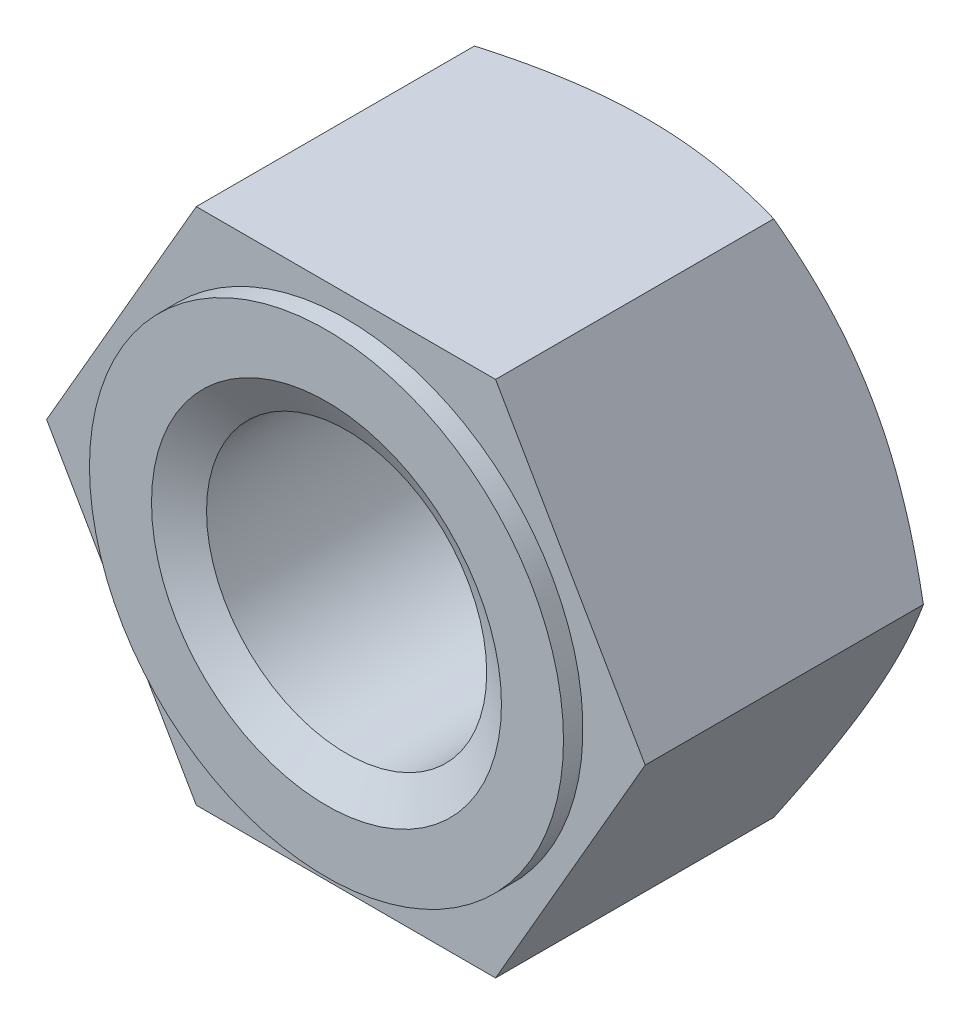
ISO-10303-21;
HEADER;
FILE_DESCRIPTION(('STEP AP214'),'2;1');
FILE_NAME('part.step','',(''),(''),'','','');
FILE_SCHEMA(('AUTOMOTIVE_DESIGN { 1 0 10303 214 1 1 1 1 }'));
ENDSEC;
DATA;
#1=APPLICATION_CONTEXT('core data for automotive mechanical design processes');
#2=APPLICATION_PROTOCOL_DEFINITION('international standard','automotive_design',2000,#1);
#3=PRODUCT_CONTEXT('',#1,'mechanical');
#4=PRODUCT('Part','Part','',(#3));
#5=PRODUCT_RELATED_PRODUCT_CATEGORY('part','',(#4));
#6=PRODUCT_DEFINITION_FORMATION('','',#4);
#7=PRODUCT_DEFINITION_CONTEXT('part definition',#1,'design');
#8=PRODUCT_DEFINITION('design','',#6,#7);
#9=PRODUCT_DEFINITION_SHAPE('','',#8);
#10=(LENGTH_UNIT() NAMED_UNIT(*) SI_UNIT(.MILLI.,.METRE.));
#11=(NAMED_UNIT(*) PLANE_ANGLE_UNIT() SI_UNIT($,.RADIAN.));
#12=(NAMED_UNIT(*) SI_UNIT($,.STERADIAN.) SOLID_ANGLE_UNIT());
#13=UNCERTAINTY_MEASURE_WITH_UNIT(LENGTH_MEASURE(1.E-05),#10,'distance_accuracy_value','');
#14=(GEOMETRIC_REPRESENTATION_CONTEXT(3) GLOBAL_UNCERTAINTY_ASSIGNED_CONTEXT((#13)) GLOBAL_UNIT_ASSIGNED_CONTEXT((#10,
#11,#12)) REPRESENTATION_CONTEXT('',''));
#15=CARTESIAN_POINT('',(0.,0.,0.));
#16=DIRECTION('',(0.,0.,1.));
#17=DIRECTION('',(1.,0.,0.));
#18=AXIS2_PLACEMENT_3D('',#15,#16,#17);
#19=CARTESIAN_POINT('',(-4.61880215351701,-8.,0.));
#20=DIRECTION('',(0.,0.,-1.));
#21=DIRECTION('',(-1.,0.,0.));
#22=AXIS2_PLACEMENT_3D('',#19,#20,#21);
#23=PLANE('',#22);
#24=DIRECTION('',(1.,0.,0.));
#25=VECTOR('',#24,1.);
#26=CARTESIAN_POINT('',(-4.61880215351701,-8.,0.));
#27=LINE('',#26,#25);
#28=CARTESIAN_POINT('',(-4.61880215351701,-8.,0.));
#29=VERTEX_POINT('',#28);
#30=CARTESIAN_POINT('',(4.61880215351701,-8.,0.));
#31=VERTEX_POINT('',#30);
#32=EDGE_CURVE('E413',#29,#31,#27,.T.);
#33=ORIENTED_EDGE('',*,*,#32,.T.);
#34=DIRECTION('',(0.5,0.866025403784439,0.));
#35=VECTOR('',#34,1.);
#36=CARTESIAN_POINT('',(4.61880215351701,-8.,0.));
#37=LINE('',#36,#35);
#38=CARTESIAN_POINT('',(9.23760430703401,0.,0.));
#39=VERTEX_POINT('',#38);
#40=EDGE_CURVE('E412',#31,#39,#37,.T.);
#41=ORIENTED_EDGE('',*,*,#40,.T.);
#42=DIRECTION('',(-0.5,0.866025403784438,0.));
#43=VECTOR('',#42,1.);
#44=CARTESIAN_POINT('',(9.23760430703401,0.,0.));
#45=LINE('',#44,#43);
#46=CARTESIAN_POINT('',(4.618802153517,8.,0.));
#47=VERTEX_POINT('',#46);
#48=EDGE_CURVE('E248',#39,#47,#45,.T.);
#49=ORIENTED_EDGE('',*,*,#48,.T.);
#50=DIRECTION('',(-1.,0.,0.));
#51=VECTOR('',#50,1.);
#52=CARTESIAN_POINT('',(4.618802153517,8.,0.));
#53=LINE('',#52,#51);
#54=CARTESIAN_POINT('',(-4.61880215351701,8.,0.));
#55=VERTEX_POINT('',#54);
#56=EDGE_CURVE('E243',#47,#55,#53,.T.);
#57=ORIENTED_EDGE('',*,*,#56,.T.);
#58=DIRECTION('',(-0.5,-0.866025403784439,0.));
#59=VECTOR('',#58,1.);
#60=CARTESIAN_POINT('',(-4.61880215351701,8.,0.));
#61=LINE('',#60,#59);
#62=CARTESIAN_POINT('',(-9.23760430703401,0.,0.));
#63=VERTEX_POINT('',#62);
#64=EDGE_CURVE('E418',#55,#63,#61,.T.);
#65=ORIENTED_EDGE('',*,*,#64,.T.);
#66=DIRECTION('',(0.5,-0.866025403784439,0.));
#67=VECTOR('',#66,1.);
#68=CARTESIAN_POINT('',(-9.23760430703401,0.,0.));
#69=LINE('',#68,#67);
#70=EDGE_CURVE('E113',#63,#29,#69,.T.);
#71=ORIENTED_EDGE('',*,*,#70,.T.);
#72=EDGE_LOOP('',(#33,#41,#49,#57,#65,#71));
#73=FACE_BOUND('',#72,.T.);
#74=CARTESIAN_POINT('',(0.,0.,0.));
#75=DIRECTION('',(0.,0.,-1.));
#76=DIRECTION('',(-1.,0.,0.));
#77=AXIS2_PLACEMENT_3D('',#74,#75,#76);
#78=CIRCLE('',#77,7.315);
#79=CARTESIAN_POINT('',(-7.315,0.,0.));
#80=VERTEX_POINT('',#79);
#81=EDGE_CURVE('E130',#80,#80,#78,.F.);
#82=ORIENTED_EDGE('',*,*,#81,.F.);
#83=EDGE_LOOP('',(#82));
#84=FACE_BOUND('',#83,.T.);
#85=ADVANCED_FACE('F16',(#73,#84),#23,.F.);
#86=CARTESIAN_POINT('',(-4.61880215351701,-8.,-9.3));
#87=DIRECTION('',(0.,-1.,0.));
#88=DIRECTION('',(1.,0.,0.));
#89=AXIS2_PLACEMENT_3D('',#86,#87,#88);
#90=PLANE('',#89);
#91=DIRECTION('',(0.,0.,1.));
#92=VECTOR('',#91,1.);
#93=CARTESIAN_POINT('',(-4.61880215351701,-8.,-9.3));
#94=LINE('',#93,#92);
#95=CARTESIAN_POINT('',(-4.618802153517,-8.,-8.58546882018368));
#96=VERTEX_POINT('',#95);
#97=EDGE_CURVE('E114',#96,#29,#94,.T.);
#98=ORIENTED_EDGE('',*,*,#97,.F.);
#99=CARTESIAN_POINT('',(-12.2497439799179,-8.,-5.47178635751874));
#100=CARTESIAN_POINT('',(-11.8984987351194,-8.,-5.64152745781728));
#101=CARTESIAN_POINT('',(-11.5464230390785,-8.,-5.80958119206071));
#102=CARTESIAN_POINT('',(-10.840161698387,-8.,-6.14134970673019));
#103=CARTESIAN_POINT('',(-10.4859757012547,-8.,-6.30506373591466));
#104=CARTESIAN_POINT('',(-9.77313142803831,-8.,-6.62805107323));
#105=CARTESIAN_POINT('',(-9.41445915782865,-8.,-6.78729360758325));
#106=CARTESIAN_POINT('',(-8.69416671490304,-8.,-7.09893883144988));
#107=CARTESIAN_POINT('',(-8.33254669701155,-8.,-7.25134187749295));
#108=CARTESIAN_POINT('',(-7.60129405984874,-8.,-7.54929869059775));
#109=CARTESIAN_POINT('',(-7.23161757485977,-8.,-7.6947453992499));
#110=CARTESIAN_POINT('',(-6.48790521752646,-8.,-7.9742475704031));
#111=CARTESIAN_POINT('',(-6.11386886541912,-8.,-8.10830176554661));
#112=CARTESIAN_POINT('',(-5.36160531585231,-8.,-8.36141638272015));
#113=CARTESIAN_POINT('',(-4.98338896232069,-8.,-8.48050868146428));
#114=CARTESIAN_POINT('',(-4.22159300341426,-8.,-8.69983373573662));
#115=CARTESIAN_POINT('',(-3.83801513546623,-8.,-8.80007245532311));
#116=CARTESIAN_POINT('',(-3.06517005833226,-8.,-8.97681673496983));
#117=CARTESIAN_POINT('',(-2.67590136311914,-8.,-9.05331597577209));
#118=CARTESIAN_POINT('',(-2.08857290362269,-8.,-9.14642984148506));
#119=CARTESIAN_POINT('',(-1.89220175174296,-8.,-9.17386398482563));
#120=CARTESIAN_POINT('',(-1.49853877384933,-8.,-9.2209808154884));
#121=CARTESIAN_POINT('',(-1.30124704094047,-8.,-9.24066427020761));
#122=CARTESIAN_POINT('',(-0.907261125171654,-8.,-9.27175001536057));
#123=CARTESIAN_POINT('',(-0.710571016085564,-8.,-9.28320372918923));
#124=CARTESIAN_POINT('',(-0.316882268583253,-8.,-9.29776943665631));
#125=CARTESIAN_POINT('',(-0.119883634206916,-8.,-9.30088153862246));
#126=CARTESIAN_POINT('',(0.274012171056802,-8.,-9.29868986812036));
#127=CARTESIAN_POINT('',(0.470909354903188,-8.,-9.29338845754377));
#128=CARTESIAN_POINT('',(0.864308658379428,-8.,-9.27450159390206));
#129=CARTESIAN_POINT('',(1.06081075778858,-8.,-9.2609157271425));
#130=CARTESIAN_POINT('',(1.53707134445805,-8.,-9.21823147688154));
#131=CARTESIAN_POINT('',(1.81646391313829,-8.,-9.18498228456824));
#132=CARTESIAN_POINT('',(2.37310809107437,-8.,-9.10358169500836));
#133=CARTESIAN_POINT('',(2.65035909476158,-8.,-9.05542623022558));
#134=CARTESIAN_POINT('',(3.20249141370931,-8.,-8.94592101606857));
#135=CARTESIAN_POINT('',(3.4773702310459,-8.,-8.88455879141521));
#136=CARTESIAN_POINT('',(4.02429975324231,-8.,-8.75051229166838));
#137=CARTESIAN_POINT('',(4.29635072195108,-8.,-8.67782908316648));
#138=CARTESIAN_POINT('',(4.84432510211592,-8.,-8.5209795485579));
#139=CARTESIAN_POINT('',(5.1201799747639,-8.,-8.43657541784));
#140=CARTESIAN_POINT('',(5.66897392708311,-8.,-8.25942754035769));
#141=CARTESIAN_POINT('',(5.94191487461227,-8.,-8.16668954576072));
#142=CARTESIAN_POINT('',(6.48378576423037,-8.,-7.97478953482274));
#143=CARTESIAN_POINT('',(6.7527296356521,-8.,-7.87566661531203));
#144=CARTESIAN_POINT('',(7.28853074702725,-8.,-7.67160282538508));
#145=CARTESIAN_POINT('',(7.55538709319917,-8.,-7.56665960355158));
#146=CARTESIAN_POINT('',(7.82127397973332,-8.,-7.45938198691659));
#147=B_SPLINE_CURVE_WITH_KNOTS('',3,(#99,#100,#101,#102,#103,#104,#105,#106,#107,#108,#109,#110,
#111,#112,#113,#114,#115,#116,#117,#118,#119,#120,#121,#122,#123,#124,#125,#126,#127,#128,#129,
#130,#131,#132,#133,#134,#135,#136,#137,#138,#139,#140,#141,#142,#143,#144,#145,#146),
.UNSPECIFIED.,.F.,.F.,(4,2,2,2,2,2,2,2,2,2,2,2,2,2,2,2,2,2,2,2,2,2,2,4),(0.,1.17034358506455,
2.34088846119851,3.51813189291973,4.69531388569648,5.88694801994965,7.0787145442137,
8.26789729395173,9.45670322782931,10.6458253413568,11.2405311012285,11.8351779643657,
12.4260760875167,13.0169665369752,13.6076911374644,14.1984452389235,15.0420672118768,
15.8859195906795,16.7305726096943,17.5751460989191,18.4404219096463,19.3051050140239,
20.1649211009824,21.0250871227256),.UNSPECIFIED.);
#148=CARTESIAN_POINT('',(0.,-8.,-9.3));
#149=VERTEX_POINT('',#148);
#150=EDGE_CURVE('E220',#96,#149,#147,.T.);
#151=ORIENTED_EDGE('',*,*,#150,.T.);
#152=CARTESIAN_POINT('',(4.61880215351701,-8.,-8.58546882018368));
#153=VERTEX_POINT('',#152);
#154=EDGE_CURVE('E214',#149,#153,#147,.T.);
#155=ORIENTED_EDGE('',*,*,#154,.T.);
#156=DIRECTION('',(0.,0.,1.));
#157=VECTOR('',#156,1.);
#158=CARTESIAN_POINT('',(4.61880215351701,-8.,-9.3));
#159=LINE('',#158,#157);
#160=EDGE_CURVE('E125',#153,#31,#159,.T.);
#161=ORIENTED_EDGE('',*,*,#160,.T.);
#162=ORIENTED_EDGE('',*,*,#32,.F.);
#163=EDGE_LOOP('',(#98,#151,#155,#161,#162));
#164=FACE_BOUND('',#163,.T.);
#165=ADVANCED_FACE('F151',(#164),#90,.T.);
#166=CARTESIAN_POINT('',(-9.23760430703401,0.,-9.3));
#167=DIRECTION('',(-0.866025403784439,-0.5,0.));
#168=DIRECTION('',(0.5,-0.866025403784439,0.));
#169=AXIS2_PLACEMENT_3D('',#166,#167,#168);
#170=PLANE('',#169);
#171=DIRECTION('',(0.,0.,1.));
#172=VECTOR('',#171,1.);
#173=CARTESIAN_POINT('',(-9.23760430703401,0.,-9.3));
#174=LINE('',#173,#172);
#175=CARTESIAN_POINT('',(-9.23760430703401,0.,-8.58546882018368));
#176=VERTEX_POINT('',#175);
#177=EDGE_CURVE('E106',#176,#63,#174,.T.);
#178=ORIENTED_EDGE('',*,*,#177,.F.);
#179=CARTESIAN_POINT('',(-9.23771977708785,0.000199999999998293,-8.58540215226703));
#180=CARTESIAN_POINT('',(-9.13619343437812,-0.175648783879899,-8.6440092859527));
#181=CARTESIAN_POINT('',(-9.03428856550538,-0.352153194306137,-8.69995659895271));
#182=CARTESIAN_POINT('',(-8.82965122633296,-0.706595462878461,-8.80579899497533));
#183=CARTESIAN_POINT('',(-8.72691841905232,-0.884533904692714,-8.85569146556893));
#184=CARTESIAN_POINT('',(-8.41707512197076,-1.42119823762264,-8.99530720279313));
#185=CARTESIAN_POINT('',(-8.20874154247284,-1.78204258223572,-9.07471882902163));
#186=CARTESIAN_POINT('',(-7.89697436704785,-2.32203917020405,-9.16783835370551));
#187=CARTESIAN_POINT('',(-7.79447216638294,-2.49957818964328,-9.19436541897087));
#188=CARTESIAN_POINT('',(-7.58900421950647,-2.8554591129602,-9.23884682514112));
#189=CARTESIAN_POINT('',(-7.4860385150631,-3.03380094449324,-9.25680192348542));
#190=CARTESIAN_POINT('',(-7.27992981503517,-3.39079168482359,-9.28368435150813));
#191=CARTESIAN_POINT('',(-7.17678715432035,-3.5694400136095,-9.29262192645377));
#192=CARTESIAN_POINT('',(-6.97040655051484,-3.92690170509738,-9.30127769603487));
#193=CARTESIAN_POINT('',(-6.86716861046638,-4.10571506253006,-9.30099617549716));
#194=CARTESIAN_POINT('',(-6.67416139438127,-4.4400133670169,-9.29185497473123));
#195=CARTESIAN_POINT('',(-6.58437849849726,-4.59552190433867,-9.28411039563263));
#196=CARTESIAN_POINT('',(-6.40502298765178,-4.90617476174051,-9.26179886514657));
#197=CARTESIAN_POINT('',(-6.31545038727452,-5.06131905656,-9.24723145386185));
#198=CARTESIAN_POINT('',(-6.04707935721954,-5.52615131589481,-9.19363930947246));
#199=CARTESIAN_POINT('',(-5.86875596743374,-5.83501648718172,-9.14473135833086));
#200=CARTESIAN_POINT('',(-5.51021755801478,-6.4560232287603,-9.02246059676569));
#201=CARTESIAN_POINT('',(-5.33004829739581,-6.76808554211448,-8.948579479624));
#202=CARTESIAN_POINT('',(-4.97239658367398,-7.38755648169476,-8.78089985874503));
#203=CARTESIAN_POINT('',(-4.79490955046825,-7.69497304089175,-8.68714073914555));
#204=CARTESIAN_POINT('',(-4.61868668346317,-8.0002,-8.58540215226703));
#205=B_SPLINE_CURVE_WITH_KNOTS('',3,(#179,#180,#181,#182,#183,#184,#185,#186,#187,#188,#189,
#190,#191,#192,#193,#194,#195,#196,#197,#198,#199,#200,#201,#202,#203,#204),.UNSPECIFIED.,.F.,
.F.,(4,2,2,2,2,2,2,2,2,2,2,2,4),(0.,0.633973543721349,1.26821965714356,2.53934712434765,
3.15934343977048,3.77928496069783,4.39852133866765,5.01773858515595,5.55680239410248,
6.09590254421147,7.17487077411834,8.27776850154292,9.37850115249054),.UNSPECIFIED.);
#206=CARTESIAN_POINT('',(-6.92820323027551,-4.,-9.3));
#207=VERTEX_POINT('',#206);
#208=EDGE_CURVE('E88',#176,#207,#205,.T.);
#209=ORIENTED_EDGE('',*,*,#208,.T.);
#210=EDGE_CURVE('E99',#207,#96,#205,.T.);
#211=ORIENTED_EDGE('',*,*,#210,.T.);
#212=ORIENTED_EDGE('',*,*,#97,.T.);
#213=ORIENTED_EDGE('',*,*,#70,.F.);
#214=EDGE_LOOP('',(#178,#209,#211,#212,#213));
#215=FACE_BOUND('',#214,.T.);
#216=ADVANCED_FACE('F111',(#215),#170,.T.);
#217=CARTESIAN_POINT('',(-4.61880215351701,8.,-9.3));
#218=DIRECTION('',(-0.866025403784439,0.5,0.));
#219=DIRECTION('',(-0.5,-0.866025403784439,0.));
#220=AXIS2_PLACEMENT_3D('',#217,#218,#219);
#221=PLANE('',#220);
#222=DIRECTION('',(0.,0.,1.));
#223=VECTOR('',#222,1.);
#224=CARTESIAN_POINT('',(-4.61880215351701,8.,-9.3));
#225=LINE('',#224,#223);
#226=CARTESIAN_POINT('',(-4.61880215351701,8.,-8.58546882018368));
#227=VERTEX_POINT('',#226);
#228=EDGE_CURVE('E115',#227,#55,#225,.T.);
#229=ORIENTED_EDGE('',*,*,#228,.F.);
#230=CARTESIAN_POINT('',(-4.61868668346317,8.0002,-8.58540215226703));
#231=CARTESIAN_POINT('',(-4.7202130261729,7.8243512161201,-8.6440092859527));
#232=CARTESIAN_POINT('',(-4.82211789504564,7.64784680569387,-8.6999565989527));
#233=CARTESIAN_POINT('',(-5.02675523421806,7.29340453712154,-8.80579899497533));
#234=CARTESIAN_POINT('',(-5.1294880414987,7.11546609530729,-8.85569146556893));
#235=CARTESIAN_POINT('',(-5.43933133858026,6.57880176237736,-8.99530720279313));
#236=CARTESIAN_POINT('',(-5.64766491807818,6.21795741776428,-9.07471882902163));
#237=CARTESIAN_POINT('',(-5.95943209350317,5.67796082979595,-9.16783835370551));
#238=CARTESIAN_POINT('',(-6.06193429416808,5.50042181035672,-9.19436541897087));
#239=CARTESIAN_POINT('',(-6.26740224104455,5.1445408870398,-9.23884682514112));
#240=CARTESIAN_POINT('',(-6.37036794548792,4.96619905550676,-9.25680192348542));
#241=CARTESIAN_POINT('',(-6.57647664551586,4.60920831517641,-9.28368435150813));
#242=CARTESIAN_POINT('',(-6.67961930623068,4.4305599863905,-9.29262192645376));
#243=CARTESIAN_POINT('',(-6.88599991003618,4.07309829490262,-9.30127769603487));
#244=CARTESIAN_POINT('',(-6.98923785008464,3.89428493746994,-9.30099617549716));
#245=CARTESIAN_POINT('',(-7.18224506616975,3.5599866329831,-9.29185497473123));
#246=CARTESIAN_POINT('',(-7.27202796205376,3.40447809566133,-9.28411039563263));
#247=CARTESIAN_POINT('',(-7.45138347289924,3.09382523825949,-9.26179886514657));
#248=CARTESIAN_POINT('',(-7.54095607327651,2.93868094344,-9.24723145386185));
#249=CARTESIAN_POINT('',(-7.80932710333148,2.47384868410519,-9.19363930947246));
#250=CARTESIAN_POINT('',(-7.98765049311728,2.16498351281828,-9.14473135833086));
#251=CARTESIAN_POINT('',(-8.34618890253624,1.5439767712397,-9.02246059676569));
#252=CARTESIAN_POINT('',(-8.52635816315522,1.23191445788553,-8.948579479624));
#253=CARTESIAN_POINT('',(-8.88400987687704,0.612443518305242,-8.78089985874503));
#254=CARTESIAN_POINT('',(-9.06149691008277,0.305026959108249,-8.68714073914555));
#255=CARTESIAN_POINT('',(-9.23771977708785,-0.000200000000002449,-8.58540215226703));
#256=B_SPLINE_CURVE_WITH_KNOTS('',3,(#230,#231,#232,#233,#234,#235,#236,#237,#238,#239,#240,
#241,#242,#243,#244,#245,#246,#247,#248,#249,#250,#251,#252,#253,#254,#255),.UNSPECIFIED.,.F.,
.F.,(4,2,2,2,2,2,2,2,2,2,2,2,4),(0.,0.633973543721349,1.26821965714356,2.53934712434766,
3.15934343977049,3.77928496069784,4.39852133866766,5.01773858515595,5.55680239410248,
6.09590254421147,7.17487077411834,8.27776850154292,9.37850115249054),.UNSPECIFIED.);
#257=CARTESIAN_POINT('',(-6.92820323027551,4.,-9.3));
#258=VERTEX_POINT('',#257);
#259=EDGE_CURVE('E108',#227,#258,#256,.T.);
#260=ORIENTED_EDGE('',*,*,#259,.T.);
#261=EDGE_CURVE('E91',#258,#176,#256,.T.);
#262=ORIENTED_EDGE('',*,*,#261,.T.);
#263=ORIENTED_EDGE('',*,*,#177,.T.);
#264=ORIENTED_EDGE('',*,*,#64,.F.);
#265=EDGE_LOOP('',(#229,#260,#262,#263,#264));
#266=FACE_BOUND('',#265,.T.);
#267=ADVANCED_FACE('F104',(#266),#221,.T.);
#268=CARTESIAN_POINT('',(4.618802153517,8.,-9.3));
#269=DIRECTION('',(0.,1.,0.));
#270=DIRECTION('',(0.,0.,1.));
#271=AXIS2_PLACEMENT_3D('',#268,#269,#270);
#272=PLANE('',#271);
#273=DIRECTION('',(0.,0.,1.));
#274=VECTOR('',#273,1.);
#275=CARTESIAN_POINT('',(4.618802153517,8.,-9.3));
#276=LINE('',#275,#274);
#277=CARTESIAN_POINT('',(4.618802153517,8.,-8.58546882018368));
#278=VERTEX_POINT('',#277);
#279=EDGE_CURVE('E118',#278,#47,#276,.T.);
#280=ORIENTED_EDGE('',*,*,#279,.F.);
#281=CARTESIAN_POINT('',(-12.2497439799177,8.,-5.47178635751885));
#282=CARTESIAN_POINT('',(-11.8984987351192,8.,-5.64152745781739));
#283=CARTESIAN_POINT('',(-11.5464230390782,8.,-5.80958119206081));
#284=CARTESIAN_POINT('',(-10.8401616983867,8.,-6.1413497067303));
#285=CARTESIAN_POINT('',(-10.4859757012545,8.,-6.30506373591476));
#286=CARTESIAN_POINT('',(-9.77313142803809,8.,-6.62805107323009));
#287=CARTESIAN_POINT('',(-9.41445915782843,8.,-6.78729360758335));
#288=CARTESIAN_POINT('',(-8.69416671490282,8.,-7.09893883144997));
#289=CARTESIAN_POINT('',(-8.33254669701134,8.,-7.25134187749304));
#290=CARTESIAN_POINT('',(-7.60129405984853,8.,-7.54929869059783));
#291=CARTESIAN_POINT('',(-7.23161757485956,8.,-7.69474539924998));
#292=CARTESIAN_POINT('',(-6.48790521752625,8.,-7.97424757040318));
#293=CARTESIAN_POINT('',(-6.11386886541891,8.,-8.10830176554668));
#294=CARTESIAN_POINT('',(-5.36160531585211,8.,-8.36141638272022));
#295=CARTESIAN_POINT('',(-4.98338896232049,8.,-8.48050868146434));
#296=CARTESIAN_POINT('',(-4.22159300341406,8.,-8.69983373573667));
#297=CARTESIAN_POINT('',(-3.83801513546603,8.,-8.80007245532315));
#298=CARTESIAN_POINT('',(-3.06517005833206,8.,-8.97681673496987));
#299=CARTESIAN_POINT('',(-2.67590136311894,8.,-9.05331597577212));
#300=CARTESIAN_POINT('',(-2.0885729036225,8.,-9.14642984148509));
#301=CARTESIAN_POINT('',(-1.89220175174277,8.,-9.17386398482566));
#302=CARTESIAN_POINT('',(-1.49853877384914,8.,-9.22098081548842));
#303=CARTESIAN_POINT('',(-1.30124704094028,8.,-9.24066427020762));
#304=CARTESIAN_POINT('',(-0.907261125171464,8.,-9.27175001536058));
#305=CARTESIAN_POINT('',(-0.710571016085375,8.,-9.28320372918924));
#306=CARTESIAN_POINT('',(-0.316882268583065,8.,-9.29776943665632));
#307=CARTESIAN_POINT('',(-0.119883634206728,8.,-9.30088153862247));
#308=CARTESIAN_POINT('',(0.274012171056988,8.,-9.29868986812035));
#309=CARTESIAN_POINT('',(0.470909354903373,8.,-9.29338845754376));
#310=CARTESIAN_POINT('',(0.864308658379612,8.,-9.27450159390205));
#311=CARTESIAN_POINT('',(1.06081075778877,8.,-9.26091572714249));
#312=CARTESIAN_POINT('',(1.53707134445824,8.,-9.21823147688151));
#313=CARTESIAN_POINT('',(1.81646391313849,8.,-9.18498228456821));
#314=CARTESIAN_POINT('',(2.37310809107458,8.,-9.10358169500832));
#315=CARTESIAN_POINT('',(2.6503590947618,8.,-9.05542623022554));
#316=CARTESIAN_POINT('',(3.20249141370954,8.,-8.94592101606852));
#317=CARTESIAN_POINT('',(3.47737023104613,8.,-8.88455879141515));
#318=CARTESIAN_POINT('',(4.02429975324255,8.,-8.75051229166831));
#319=CARTESIAN_POINT('',(4.29635072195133,8.,-8.67782908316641));
#320=CARTESIAN_POINT('',(4.84432510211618,8.,-8.52097954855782));
#321=CARTESIAN_POINT('',(5.12017997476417,8.,-8.43657541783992));
#322=CARTESIAN_POINT('',(5.66897392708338,8.,-8.25942754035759));
#323=CARTESIAN_POINT('',(5.94191487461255,8.,-8.16668954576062));
#324=CARTESIAN_POINT('',(6.48378576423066,8.,-7.97478953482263));
#325=CARTESIAN_POINT('',(6.7527296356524,8.,-7.87566661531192));
#326=CARTESIAN_POINT('',(7.28853074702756,8.,-7.67160282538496));
#327=CARTESIAN_POINT('',(7.55538709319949,8.,-7.56665960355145));
#328=CARTESIAN_POINT('',(7.82127397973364,8.,-7.45938198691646));
#329=B_SPLINE_CURVE_WITH_KNOTS('',3,(#281,#282,#283,#284,#285,#286,#287,#288,#289,#290,#291,
#292,#293,#294,#295,#296,#297,#298,#299,#300,#301,#302,#303,#304,#305,#306,#307,#308,#309,#310,
#311,#312,#313,#314,#315,#316,#317,#318,#319,#320,#321,#322,#323,#324,#325,#326,#327,#328),
.UNSPECIFIED.,.F.,.F.,(4,2,2,2,2,2,2,2,2,2,2,2,2,2,2,2,2,2,2,2,2,2,2,4),(0.,1.17034358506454,
2.3408884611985,3.51813189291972,4.69531388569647,5.88694801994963,7.07871454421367,
8.2678972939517,9.45670322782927,10.6458253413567,11.2405311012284,11.8351779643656,
12.4260760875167,13.0169665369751,13.6076911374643,14.1984452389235,15.0420672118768,
15.8859195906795,16.7305726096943,17.5751460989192,18.4404219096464,19.305105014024,
20.1649211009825,21.0250871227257),.UNSPECIFIED.);
#330=CARTESIAN_POINT('',(0.,8.,-9.3));
#331=VERTEX_POINT('',#330);
#332=EDGE_CURVE('E176',#278,#331,#329,.F.);
#333=ORIENTED_EDGE('',*,*,#332,.T.);
#334=EDGE_CURVE('E98',#331,#227,#329,.F.);
#335=ORIENTED_EDGE('',*,*,#334,.T.);
#336=ORIENTED_EDGE('',*,*,#228,.T.);
#337=ORIENTED_EDGE('',*,*,#56,.F.);
#338=EDGE_LOOP('',(#280,#333,#335,#336,#337));
#339=FACE_BOUND('',#338,.T.);
#340=ADVANCED_FACE('F229',(#339),#272,.T.);
#341=CARTESIAN_POINT('',(9.23760430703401,0.,-9.3));
#342=DIRECTION('',(0.866025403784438,0.5,0.));
#343=DIRECTION('',(-0.5,0.866025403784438,0.));
#344=AXIS2_PLACEMENT_3D('',#341,#342,#343);
#345=PLANE('',#344);
#346=DIRECTION('',(0.,0.,1.));
#347=VECTOR('',#346,1.);
#348=CARTESIAN_POINT('',(9.23760430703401,0.,-9.3));
#349=LINE('',#348,#347);
#350=CARTESIAN_POINT('',(9.23760430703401,0.,-8.58546882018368));
#351=VERTEX_POINT('',#350);
#352=EDGE_CURVE('E123',#351,#39,#349,.T.);
#353=ORIENTED_EDGE('',*,*,#352,.F.);
#354=CARTESIAN_POINT('',(9.23771977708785,-0.000199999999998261,-8.58540215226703));
#355=CARTESIAN_POINT('',(9.13619343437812,0.175648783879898,-8.6440092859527));
#356=CARTESIAN_POINT('',(9.03428856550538,0.352153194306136,-8.69995659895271));
#357=CARTESIAN_POINT('',(8.82965122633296,0.706595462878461,-8.80579899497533));
#358=CARTESIAN_POINT('',(8.72691841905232,0.884533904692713,-8.85569146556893));
#359=CARTESIAN_POINT('',(8.41707512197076,1.42119823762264,-8.99530720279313));
#360=CARTESIAN_POINT('',(8.20874154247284,1.78204258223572,-9.07471882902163));
#361=CARTESIAN_POINT('',(7.89697436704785,2.32203917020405,-9.16783835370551));
#362=CARTESIAN_POINT('',(7.79447216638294,2.49957818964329,-9.19436541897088));
#363=CARTESIAN_POINT('',(7.58900421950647,2.8554591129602,-9.23884682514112));
#364=CARTESIAN_POINT('',(7.4860385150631,3.03380094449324,-9.25680192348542));
#365=CARTESIAN_POINT('',(7.27992981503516,3.39079168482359,-9.28368435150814));
#366=CARTESIAN_POINT('',(7.17678715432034,3.5694400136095,-9.29262192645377));
#367=CARTESIAN_POINT('',(6.97040655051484,3.92690170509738,-9.30127769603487));
#368=CARTESIAN_POINT('',(6.86716861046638,4.10571506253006,-9.30099617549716));
#369=CARTESIAN_POINT('',(6.67416139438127,4.4400133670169,-9.29185497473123));
#370=CARTESIAN_POINT('',(6.58437849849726,4.59552190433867,-9.28411039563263));
#371=CARTESIAN_POINT('',(6.40502298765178,4.90617476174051,-9.26179886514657));
#372=CARTESIAN_POINT('',(6.31545038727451,5.06131905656,-9.24723145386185));
#373=CARTESIAN_POINT('',(6.04707935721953,5.52615131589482,-9.19363930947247));
#374=CARTESIAN_POINT('',(5.86875596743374,5.83501648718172,-9.14473135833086));
#375=CARTESIAN_POINT('',(5.51021755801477,6.4560232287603,-9.02246059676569));
#376=CARTESIAN_POINT('',(5.3300482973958,6.76808554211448,-8.948579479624));
#377=CARTESIAN_POINT('',(4.97239658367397,7.38755648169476,-8.78089985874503));
#378=CARTESIAN_POINT('',(4.79490955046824,7.69497304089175,-8.68714073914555));
#379=CARTESIAN_POINT('',(4.61868668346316,8.0002,-8.58540215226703));
#380=B_SPLINE_CURVE_WITH_KNOTS('',3,(#354,#355,#356,#357,#358,#359,#360,#361,#362,#363,#364,
#365,#366,#367,#368,#369,#370,#371,#372,#373,#374,#375,#376,#377,#378,#379),.UNSPECIFIED.,.F.,
.F.,(4,2,2,2,2,2,2,2,2,2,2,2,4),(0.,0.63397354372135,1.26821965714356,2.53934712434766,
3.15934343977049,3.77928496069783,4.39852133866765,5.01773858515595,5.55680239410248,
6.09590254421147,7.17487077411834,8.27776850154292,9.37850115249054),.UNSPECIFIED.);
#381=CARTESIAN_POINT('',(6.92820323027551,4.,-9.3));
#382=VERTEX_POINT('',#381);
#383=EDGE_CURVE('E39',#351,#382,#380,.T.);
#384=ORIENTED_EDGE('',*,*,#383,.T.);
#385=EDGE_CURVE('E250',#382,#278,#380,.T.);
#386=ORIENTED_EDGE('',*,*,#385,.T.);
#387=ORIENTED_EDGE('',*,*,#279,.T.);
#388=ORIENTED_EDGE('',*,*,#48,.F.);
#389=EDGE_LOOP('',(#353,#384,#386,#387,#388));
#390=FACE_BOUND('',#389,.T.);
#391=ADVANCED_FACE('F225',(#390),#345,.T.);
#392=CARTESIAN_POINT('',(4.61880215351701,-8.,-9.3));
#393=DIRECTION('',(0.866025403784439,-0.5,0.));
#394=DIRECTION('',(0.5,0.866025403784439,0.));
#395=AXIS2_PLACEMENT_3D('',#392,#393,#394);
#396=PLANE('',#395);
#397=ORIENTED_EDGE('',*,*,#160,.F.);
#398=CARTESIAN_POINT('',(4.61868668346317,-8.0002,-8.58540215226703));
#399=CARTESIAN_POINT('',(4.7202130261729,-7.8243512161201,-8.6440092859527));
#400=CARTESIAN_POINT('',(4.82211789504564,-7.64784680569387,-8.6999565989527));
#401=CARTESIAN_POINT('',(5.02675523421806,-7.29340453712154,-8.80579899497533));
#402=CARTESIAN_POINT('',(5.1294880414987,-7.11546609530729,-8.85569146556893));
#403=CARTESIAN_POINT('',(5.43933133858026,-6.57880176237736,-8.99530720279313));
#404=CARTESIAN_POINT('',(5.64766491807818,-6.21795741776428,-9.07471882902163));
#405=CARTESIAN_POINT('',(5.95943209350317,-5.67796082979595,-9.16783835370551));
#406=CARTESIAN_POINT('',(6.06193429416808,-5.50042181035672,-9.19436541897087));
#407=CARTESIAN_POINT('',(6.26740224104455,-5.1445408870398,-9.23884682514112));
#408=CARTESIAN_POINT('',(6.37036794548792,-4.96619905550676,-9.25680192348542));
#409=CARTESIAN_POINT('',(6.57647664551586,-4.60920831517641,-9.28368435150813));
#410=CARTESIAN_POINT('',(6.67961930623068,-4.4305599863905,-9.29262192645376));
#411=CARTESIAN_POINT('',(6.88599991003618,-4.07309829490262,-9.30127769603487));
#412=CARTESIAN_POINT('',(6.98923785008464,-3.89428493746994,-9.30099617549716));
#413=CARTESIAN_POINT('',(7.18224506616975,-3.5599866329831,-9.29185497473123));
#414=CARTESIAN_POINT('',(7.27202796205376,-3.40447809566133,-9.28411039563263));
#415=CARTESIAN_POINT('',(7.45138347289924,-3.09382523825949,-9.26179886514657));
#416=CARTESIAN_POINT('',(7.54095607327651,-2.93868094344,-9.24723145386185));
#417=CARTESIAN_POINT('',(7.80932710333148,-2.47384868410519,-9.19363930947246));
#418=CARTESIAN_POINT('',(7.98765049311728,-2.16498351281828,-9.14473135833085));
#419=CARTESIAN_POINT('',(8.34618890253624,-1.5439767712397,-9.02246059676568));
#420=CARTESIAN_POINT('',(8.52635816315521,-1.23191445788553,-8.948579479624));
#421=CARTESIAN_POINT('',(8.88400987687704,-0.612443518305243,-8.78089985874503));
#422=CARTESIAN_POINT('',(9.06149691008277,-0.30502695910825,-8.68714073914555));
#423=CARTESIAN_POINT('',(9.23771977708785,0.0002000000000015,-8.58540215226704));
#424=B_SPLINE_CURVE_WITH_KNOTS('',3,(#398,#399,#400,#401,#402,#403,#404,#405,#406,#407,#408,
#409,#410,#411,#412,#413,#414,#415,#416,#417,#418,#419,#420,#421,#422,#423),.UNSPECIFIED.,.F.,
.F.,(4,2,2,2,2,2,2,2,2,2,2,2,4),(0.,0.63397354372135,1.26821965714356,2.53934712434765,
3.15934343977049,3.77928496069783,4.39852133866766,5.01773858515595,5.55680239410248,
6.09590254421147,7.17487077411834,8.27776850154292,9.37850115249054),.UNSPECIFIED.);
#425=CARTESIAN_POINT('',(6.92820323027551,-4.,-9.3));
#426=VERTEX_POINT('',#425);
#427=EDGE_CURVE('E254',#153,#426,#424,.T.);
#428=ORIENTED_EDGE('',*,*,#427,.T.);
#429=EDGE_CURVE('E198',#426,#351,#424,.T.);
#430=ORIENTED_EDGE('',*,*,#429,.T.);
#431=ORIENTED_EDGE('',*,*,#352,.T.);
#432=ORIENTED_EDGE('',*,*,#40,.F.);
#433=EDGE_LOOP('',(#397,#428,#430,#431,#432));
#434=FACE_BOUND('',#433,.T.);
#435=ADVANCED_FACE('F222',(#434),#396,.T.);
#436=CARTESIAN_POINT('',(-4.61880215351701,-8.,-9.3));
#437=DIRECTION('',(0.,0.,-1.));
#438=DIRECTION('',(-1.,0.,0.));
#439=AXIS2_PLACEMENT_3D('',#436,#437,#438);
#440=PLANE('',#439);
#441=CARTESIAN_POINT('',(0.,0.,-9.3));
#442=DIRECTION('',(0.,0.,1.));
#443=DIRECTION('',(1.,0.,0.));
#444=AXIS2_PLACEMENT_3D('',#441,#442,#443);
#445=CIRCLE('',#444,5.4);
#446=CARTESIAN_POINT('',(5.4,0.,-9.3));
#447=VERTEX_POINT('',#446);
#448=EDGE_CURVE('E257',#447,#447,#445,.T.);
#449=ORIENTED_EDGE('',*,*,#448,.T.);
#450=EDGE_LOOP('',(#449));
#451=FACE_BOUND('',#450,.T.);
#452=CARTESIAN_POINT('',(0.,0.,-9.3));
#453=DIRECTION('',(0.,0.,-1.));
#454=DIRECTION('',(-1.,0.,0.));
#455=AXIS2_PLACEMENT_3D('',#452,#453,#454);
#456=CIRCLE('',#455,8.);
#457=EDGE_CURVE('E93',#207,#258,#456,.T.);
#458=ORIENTED_EDGE('',*,*,#457,.T.);
#459=CARTESIAN_POINT('',(0.,0.,-9.3));
#460=DIRECTION('',(0.,0.,-1.));
#461=DIRECTION('',(-1.,0.,0.));
#462=AXIS2_PLACEMENT_3D('',#459,#460,#461);
#463=CIRCLE('',#462,8.);
#464=EDGE_CURVE('E31',#258,#331,#463,.T.);
#465=ORIENTED_EDGE('',*,*,#464,.T.);
#466=EDGE_CURVE('E129',#331,#382,#456,.T.);
#467=ORIENTED_EDGE('',*,*,#466,.T.);
#468=EDGE_CURVE('E304',#382,#426,#456,.T.);
#469=ORIENTED_EDGE('',*,*,#468,.T.);
#470=EDGE_CURVE('E302',#426,#149,#456,.T.);
#471=ORIENTED_EDGE('',*,*,#470,.T.);
#472=EDGE_CURVE('E128',#149,#207,#456,.T.);
#473=ORIENTED_EDGE('',*,*,#472,.T.);
#474=EDGE_LOOP('',(#458,#465,#467,#469,#471,#473));
#475=FACE_BOUND('',#474,.T.);
#476=ADVANCED_FACE('F163',(#451,#475),#440,.T.);
#477=CARTESIAN_POINT('',(0.,0.,-9.3));
#478=DIRECTION('',(0.,0.,1.));
#479=DIRECTION('',(1.,0.,0.));
#480=AXIS2_PLACEMENT_3D('',#477,#478,#479);
#481=CYLINDRICAL_SURFACE('',#480,4.3235);
#482=CARTESIAN_POINT('',(0.,0.,-0.0215175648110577));
#483=DIRECTION('',(0.,0.,1.));
#484=DIRECTION('',(1.,0.,0.));
#485=AXIS2_PLACEMENT_3D('',#482,#483,#484);
#486=CIRCLE('',#485,4.3235);
#487=CARTESIAN_POINT('',(4.3235,0.,-0.0215175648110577));
#488=VERTEX_POINT('',#487);
#489=EDGE_CURVE('E24',#488,#488,#486,.T.);
#490=ORIENTED_EDGE('',*,*,#489,.T.);
#491=EDGE_LOOP('',(#490));
#492=FACE_BOUND('',#491,.T.);
#493=CARTESIAN_POINT('',(0.,0.,-8.67848243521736));
#494=DIRECTION('',(0.,0.,1.));
#495=DIRECTION('',(1.,0.,0.));
#496=AXIS2_PLACEMENT_3D('',#493,#494,#495);
#497=CIRCLE('',#496,4.3235);
#498=CARTESIAN_POINT('',(4.3235,0.,-8.67848243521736));
#499=VERTEX_POINT('',#498);
#500=EDGE_CURVE('E261',#499,#499,#497,.T.);
#501=ORIENTED_EDGE('',*,*,#500,.F.);
#502=EDGE_LOOP('',(#501));
#503=FACE_BOUND('',#502,.T.);
#504=ADVANCED_FACE('F135',(#492,#503),#481,.F.);
#505=CARTESIAN_POINT('',(0.,0.,-9.3));
#506=DIRECTION('',(0.,0.,1.));
#507=DIRECTION('',(1.,0.,0.));
#508=AXIS2_PLACEMENT_3D('',#505,#506,#507);
#509=CONICAL_SURFACE('',#508,8.,1.0471975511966);
#510=ORIENTED_EDGE('',*,*,#457,.F.);
#511=ORIENTED_EDGE('',*,*,#208,.F.);
#512=ORIENTED_EDGE('',*,*,#261,.F.);
#513=EDGE_LOOP('',(#510,#511,#512));
#514=FACE_BOUND('',#513,.T.);
#515=ADVANCED_FACE('F90',(#514),#509,.T.);
#516=ORIENTED_EDGE('',*,*,#472,.F.);
#517=ORIENTED_EDGE('',*,*,#150,.F.);
#518=ORIENTED_EDGE('',*,*,#210,.F.);
#519=EDGE_LOOP('',(#516,#517,#518));
#520=FACE_BOUND('',#519,.T.);
#521=ADVANCED_FACE('F293',(#520),#509,.T.);
#522=ORIENTED_EDGE('',*,*,#470,.F.);
#523=ORIENTED_EDGE('',*,*,#427,.F.);
#524=ORIENTED_EDGE('',*,*,#154,.F.);
#525=EDGE_LOOP('',(#522,#523,#524));
#526=FACE_BOUND('',#525,.T.);
#527=ADVANCED_FACE('F192',(#526),#509,.T.);
#528=ORIENTED_EDGE('',*,*,#429,.F.);
#529=ORIENTED_EDGE('',*,*,#468,.F.);
#530=ORIENTED_EDGE('',*,*,#383,.F.);
#531=EDGE_LOOP('',(#528,#529,#530));
#532=FACE_BOUND('',#531,.T.);
#533=ADVANCED_FACE('F187',(#532),#509,.T.);
#534=ORIENTED_EDGE('',*,*,#385,.F.);
#535=ORIENTED_EDGE('',*,*,#466,.F.);
#536=ORIENTED_EDGE('',*,*,#332,.F.);
#537=EDGE_LOOP('',(#534,#535,#536));
#538=FACE_BOUND('',#537,.T.);
#539=ADVANCED_FACE('F191',(#538),#509,.T.);
#540=ORIENTED_EDGE('',*,*,#334,.F.);
#541=ORIENTED_EDGE('',*,*,#464,.F.);
#542=ORIENTED_EDGE('',*,*,#259,.F.);
#543=EDGE_LOOP('',(#540,#541,#542));
#544=FACE_BOUND('',#543,.T.);
#545=ADVANCED_FACE('F193',(#544),#509,.T.);
#546=CARTESIAN_POINT('',(0.,0.,-8.67848243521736));
#547=DIRECTION('',(0.,0.,-1.));
#548=DIRECTION('',(-1.,0.,0.));
#549=AXIS2_PLACEMENT_3D('',#546,#547,#548);
#550=CONICAL_SURFACE('',#549,4.3235,1.0471975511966);
#551=ORIENTED_EDGE('',*,*,#448,.F.);
#552=EDGE_LOOP('',(#551));
#553=FACE_BOUND('',#552,.T.);
#554=ORIENTED_EDGE('',*,*,#500,.T.);
#555=EDGE_LOOP('',(#554));
#556=FACE_BOUND('',#555,.T.);
#557=ADVANCED_FACE('F194',(#553,#556),#550,.F.);
#558=CARTESIAN_POINT('',(0.,0.,0.599999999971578));
#559=DIRECTION('',(0.,0.,1.));
#560=DIRECTION('',(1.,0.,0.));
#561=AXIS2_PLACEMENT_3D('',#558,#559,#560);
#562=PLANE('',#561);
#563=CARTESIAN_POINT('',(0.,0.,0.599999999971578));
#564=DIRECTION('',(0.,0.,1.));
#565=DIRECTION('',(1.,0.,0.));
#566=AXIS2_PLACEMENT_3D('',#563,#564,#565);
#567=CIRCLE('',#566,5.4);
#568=CARTESIAN_POINT('',(5.4,0.,0.599999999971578));
#569=VERTEX_POINT('',#568);
#570=EDGE_CURVE('E11',#569,#569,#567,.F.);
#571=ORIENTED_EDGE('',*,*,#570,.T.);
#572=EDGE_LOOP('',(#571));
#573=FACE_BOUND('',#572,.T.);
#574=CARTESIAN_POINT('',(0.,0.,0.599999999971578));
#575=DIRECTION('',(0.,0.,1.));
#576=DIRECTION('',(1.,0.,0.));
#577=AXIS2_PLACEMENT_3D('',#574,#575,#576);
#578=CIRCLE('',#577,7.315);
#579=CARTESIAN_POINT('',(7.315,0.,0.599999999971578));
#580=VERTEX_POINT('',#579);
#581=EDGE_CURVE('E266',#580,#580,#578,.T.);
#582=ORIENTED_EDGE('',*,*,#581,.T.);
#583=EDGE_LOOP('',(#582));
#584=FACE_BOUND('',#583,.T.);
#585=ADVANCED_FACE('F146',(#573,#584),#562,.T.);
#586=CARTESIAN_POINT('',(0.,0.,0.599999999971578));
#587=DIRECTION('',(0.,0.,-1.));
#588=DIRECTION('',(-1.,0.,0.));
#589=AXIS2_PLACEMENT_3D('',#586,#587,#588);
#590=CYLINDRICAL_SURFACE('',#589,7.315);
#591=ORIENTED_EDGE('',*,*,#581,.F.);
#592=EDGE_LOOP('',(#591));
#593=FACE_BOUND('',#592,.T.);
#594=ORIENTED_EDGE('',*,*,#81,.T.);
#595=EDGE_LOOP('',(#594));
#596=FACE_BOUND('',#595,.T.);
#597=ADVANCED_FACE('F139',(#593,#596),#590,.T.);
#598=CARTESIAN_POINT('',(0.,0.,-0.0215175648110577));
#599=DIRECTION('',(0.,0.,1.));
#600=DIRECTION('',(1.,0.,0.));
#601=AXIS2_PLACEMENT_3D('',#598,#599,#600);
#602=CONICAL_SURFACE('',#601,4.3235,1.0471975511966);
#603=ORIENTED_EDGE('',*,*,#570,.F.);
#604=EDGE_LOOP('',(#603));
#605=FACE_BOUND('',#604,.T.);
#606=ORIENTED_EDGE('',*,*,#489,.F.);
#607=EDGE_LOOP('',(#606));
#608=FACE_BOUND('',#607,.T.);
#609=ADVANCED_FACE('F18',(#605,#608),#602,.F.);
#610=CLOSED_SHELL('',(#85,#165,#216,#267,#340,#391,#435,#476,#504,#515,#521,#527,#533,#539,#545,
#557,#585,#597,#609));
#611=MANIFOLD_SOLID_BREP('B1',#610);
#612=ADVANCED_BREP_SHAPE_REPRESENTATION('',(#18,#611),#14);
#613=SHAPE_DEFINITION_REPRESENTATION(#9,#612);
ENDSEC;
END-ISO-10303-21;
